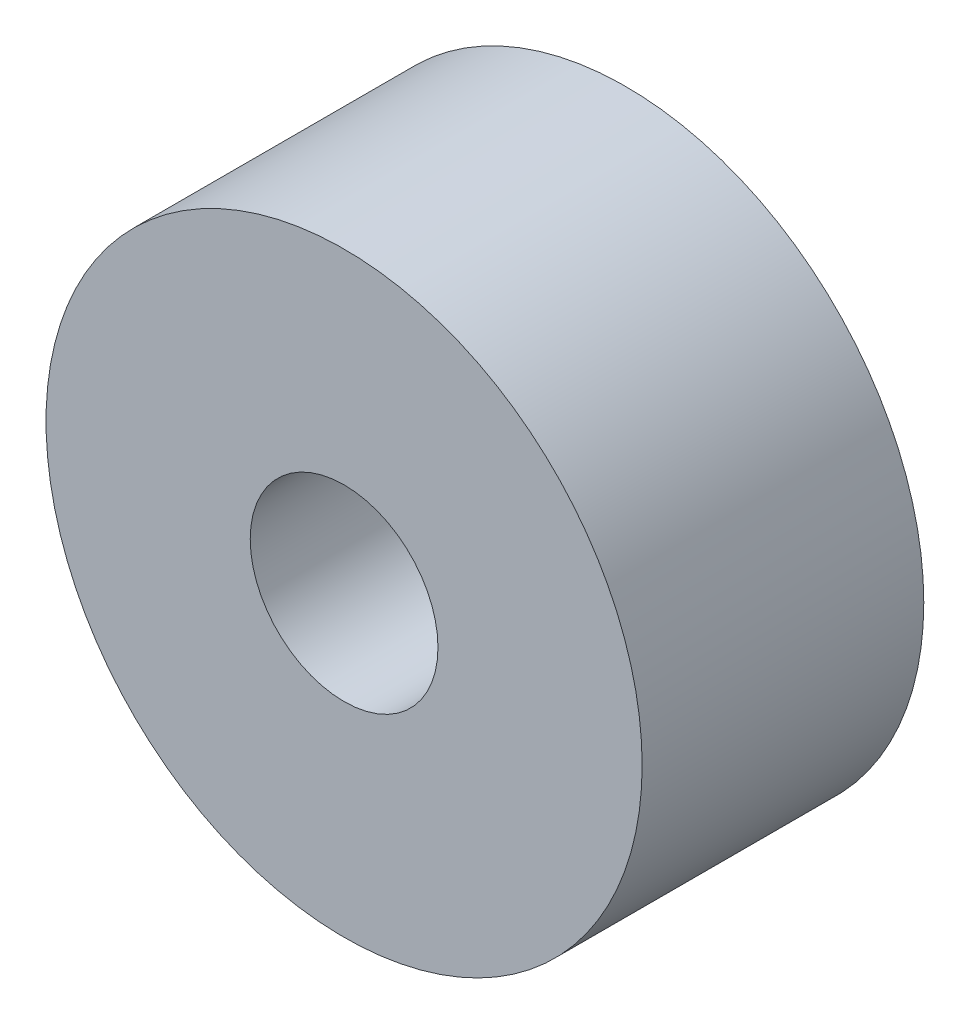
from build123d import *

# Parameters (mm, degrees)
SKETCH1_R           = 3.175
SKETCH1_R_2         = 1
BOSS_EXTRUDE1_DEPTH = 3


with BuildPart() as part:
    # Sketch1 → Boss-Extrude1 (new body)
    with BuildSketch(Plane.XY):
        Circle(SKETCH1_R)
        Circle(SKETCH1_R_2, mode=Mode.SUBTRACT)
    extrude(amount=BOSS_EXTRUDE1_DEPTH)


solid = part.part
